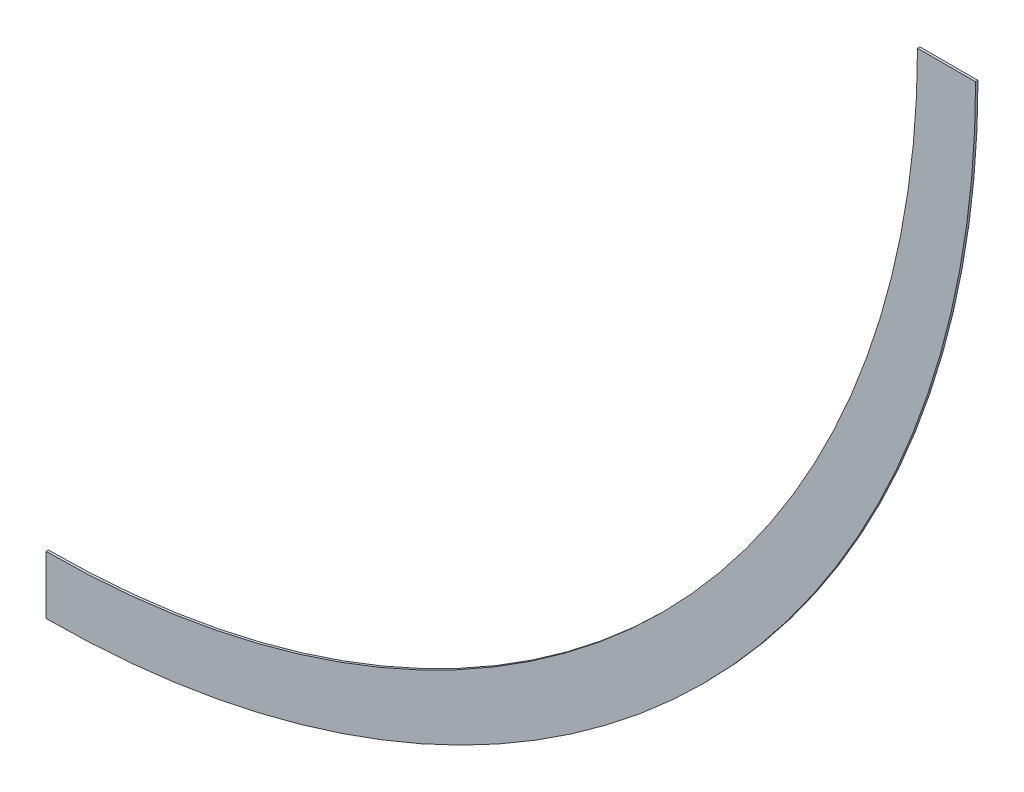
from build123d import *

# Parameters (mm, degrees)
MAIN_BODY_DEPTH         = 1.5875
CUT_EXTRUDE1_DEPTH      = 1725.658918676
CUT_EXTRUDE1_DEPTH_BACK = 1725.658918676


with BuildPart() as part:
    # Sketch9 → Main body (new, symmetric)
    with BuildSketch(Plane(origin=(0, 0, 0), x_dir=(0, 1, 0), z_dir=(0, 0, 1))):
        with BuildLine():
            Line((-1143.3175, 75.737811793), (-1219.5175, 75.737811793))
            Line((-1219.5175, 75.737811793), (-1219.5175, 0))
            ThreePointArc((-1219.5175, 0), (-862.329094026, -862.329094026), (0, -1219.5175))
            Line((0, -1219.5175), (75.746594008, -1219.5175))
            Line((75.746594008, -1219.5175), (75.746594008, -1143.3175))
            Line((75.746594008, -1143.3175), (0, -1143.3175))
            ThreePointArc((0, -1143.3175), (-808.447557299, -808.447557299), (-1143.3175, 0))
            Line((-1143.3175, 0), (-1143.3175, 75.737811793))
        make_face()
    extrude(amount=MAIN_BODY_DEPTH, both=True)

    # Sketch10 → Cut-Extrude1 (cut, two sides: drawn at the far end of the back side and taken through both)
    with BuildSketch(Plane(origin=(0, 0, 0), x_dir=(0, 1, 0), z_dir=(0, 0, 1)).offset(-CUT_EXTRUDE1_DEPTH_BACK)):
        Polygon((0, -1309.904715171), (381.551881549, -1309.904715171), (381.551881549, 358.87600297), (-1266.38554501, 358.87600297), (-1294.291480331, 0), (0, 0), align=None)
    extrude(amount=CUT_EXTRUDE1_DEPTH + CUT_EXTRUDE1_DEPTH_BACK, mode=Mode.SUBTRACT)


solid = part.part
